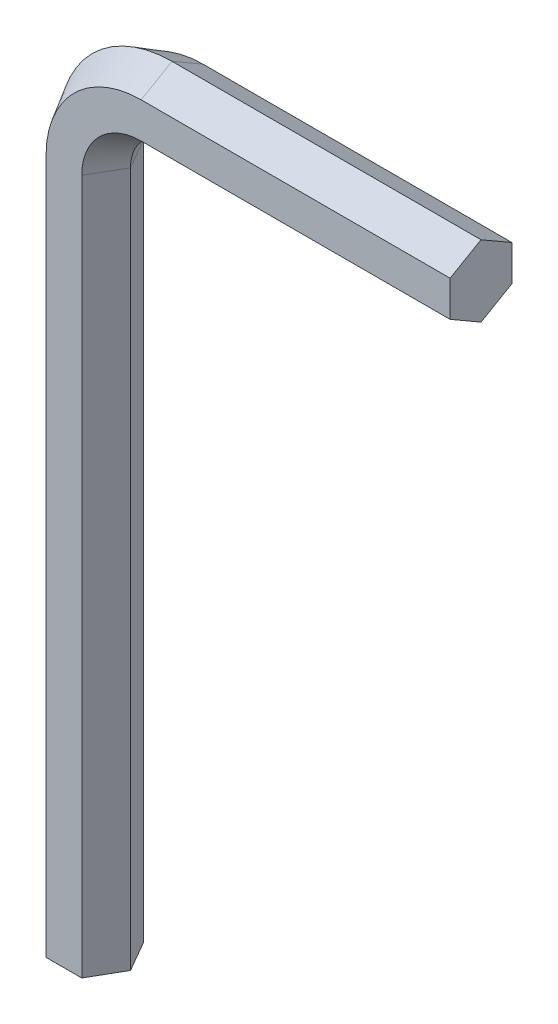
from build123d import *


with BuildPart() as part:
    # Sweep1: sweep along a path in Sketch1
    with BuildLine(Plane.XY) as sweep1_path:
        Line((0, 0), (0, 45))
        ThreePointArc((0, 45), (1.464466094, 48.535533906), (5, 50))
        Line((5, 50), (25, 50))
    # Sketch2 → Sweep1 (sweep)
    with BuildSketch(Plane(origin=(0, 0, 0), x_dir=(1, 0, 0), z_dir=(0, 1, 0))):
        Polygon((-2.309401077, 0), (-1.154700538, -2), (1.154700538, -2), (2.309401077, 0), (1.154700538, 2), (-1.154700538, 2), align=None)
    sweep(path=sweep1_path.line)


solid = part.part
